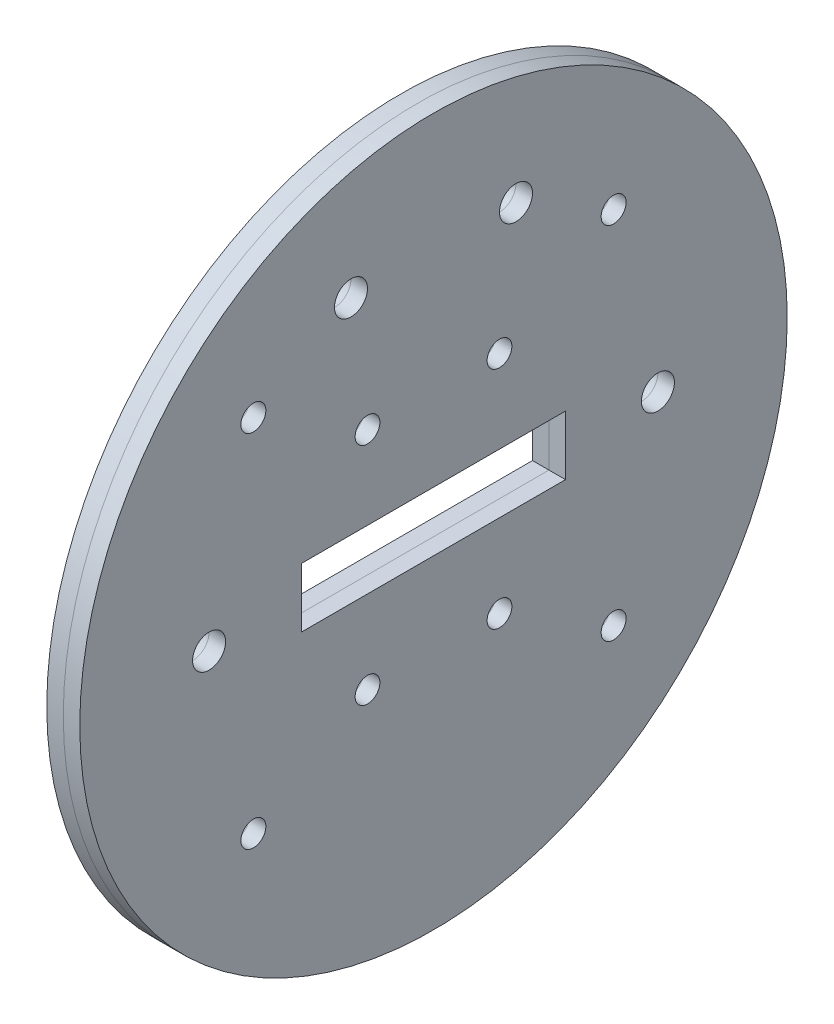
from build123d import *

# Parameters (mm, degrees)
SKETCH1_R               = 68.072
BOSS_EXTRUDE1_DEPTH     = 3.175
SKETCH4_R               = 68.072
BOSS_EXTRUDE2_DEPTH     = 3.175
CUT_EXTRUDE1_DEPTH      = 97.320688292
CUT_EXTRUDE1_DEPTH_BACK = 97.320688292
SKETCH2_R               = 3.175
CUT_EXTRUDE2_DEPTH      = 97.320688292
CUT_EXTRUDE2_DEPTH_BACK = 97.320688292
SKETCH3_W               = 50.8
SKETCH3_H               = 11.43
SKETCH5_R               = 3.175
CUT_EXTRUDE3_DEPTH      = 97.477545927
SKETCH6_R               = 2.38125
CUT_EXTRUDE4_DEPTH      = 97.477545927
SKETCH7_R               = 2.4003
CUT_EXTRUDE5_DEPTH      = 97.477545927


with BuildPart() as part:
    # Sketch1 → Boss-Extrude1 (new body)
    with BuildSketch(Plane(origin=(0, 0, 0), x_dir=(0, 0, -1), z_dir=(1, 0, 0))):
        Circle(SKETCH1_R)
    extrude(amount=BOSS_EXTRUDE1_DEPTH)


with BuildPart() as body_2:
    # Sketch4 → Boss-Extrude2 (new body)
    with BuildSketch(Plane(origin=(3.175, 0, 0), x_dir=(0, 0, -1), z_dir=(1, 0, 0))):
        Circle(SKETCH4_R)
    extrude(amount=BOSS_EXTRUDE2_DEPTH)


with BuildPart() as cut_extrude1_tool:
    # Sketch2 → Cut-Extrude1 (new, two sides: drawn at the far end of the back side and taken through both)
    with BuildSketch(Plane(origin=(3.175, 0, 0), x_dir=(0, 0, -1), z_dir=(1, 0, 0)).offset(-CUT_EXTRUDE1_DEPTH_BACK)):
        with Locations((43.18, 0)):
            Circle(SKETCH2_R)
        with Locations((-43.18, 0)):
            Circle(SKETCH2_R)
    extrude(amount=CUT_EXTRUDE1_DEPTH + CUT_EXTRUDE1_DEPTH_BACK)


with BuildPart() as part_1:
    add(part.part)

    # Cut-Extrude1: cut by cut_extrude1_tool
    add(cut_extrude1_tool.part, mode=Mode.SUBTRACT)


with BuildPart() as body_2_1:
    add(body_2.part)

    # Cut-Extrude1: cut by cut_extrude1_tool
    add(cut_extrude1_tool.part, mode=Mode.SUBTRACT)


with BuildPart() as cut_extrude2_tool:
    # Sketch3 → Cut-Extrude2 (new, two sides: drawn at the far end of the back side and taken through both)
    with BuildSketch(Plane(origin=(3.175, 0, 0), x_dir=(0, 0, -1), z_dir=(1, 0, 0)).offset(-CUT_EXTRUDE2_DEPTH_BACK)):
        Rectangle(SKETCH3_W, SKETCH3_H)
    extrude(amount=CUT_EXTRUDE2_DEPTH + CUT_EXTRUDE2_DEPTH_BACK)


with BuildPart() as part_2:
    add(part_1.part)

    # Cut-Extrude2: cut by cut_extrude2_tool
    add(cut_extrude2_tool.part, mode=Mode.SUBTRACT)


with BuildPart() as body_2_2:
    add(body_2_1.part)

    # Cut-Extrude2: cut by cut_extrude2_tool
    add(cut_extrude2_tool.part, mode=Mode.SUBTRACT)


with BuildPart() as cut_extrude3_tool:
    # Sketch5 → Cut-Extrude3 (new, through all)
    with BuildSketch(Plane(origin=(6.35, 0, 0), x_dir=(0, 0, -1), z_dir=(1, 0, 0))):
        with Locations((-15.875, 45.212)):
            Circle(SKETCH5_R)
        with Locations((15.875, 45.212)):
            Circle(SKETCH5_R)
    extrude(amount=-CUT_EXTRUDE3_DEPTH)


with BuildPart() as part_3:
    add(part_2.part)

    # Cut-Extrude3: cut by cut_extrude3_tool
    add(cut_extrude3_tool.part, mode=Mode.SUBTRACT)


with BuildPart() as body_2_3:
    add(body_2_2.part)

    # Cut-Extrude3: cut by cut_extrude3_tool
    add(cut_extrude3_tool.part, mode=Mode.SUBTRACT)


with BuildPart() as cut_extrude4_tool:
    # Sketch6 → Cut-Extrude4 (new, through all)
    with BuildSketch(Plane(origin=(6.35, 0, 0), x_dir=(0, 0, -1), z_dir=(1, 0, 0))):
        with Locations((-12.7, 21.66874)):
            Circle(SKETCH6_R)
        with Locations((12.7, 21.66874)):
            Circle(SKETCH6_R)
        with Locations((12.7, -21.66874)):
            Circle(SKETCH6_R)
        with Locations((-12.7, -21.66874)):
            Circle(SKETCH6_R)
    extrude(amount=-CUT_EXTRUDE4_DEPTH)


with BuildPart() as part_4:
    add(part_3.part)

    # Cut-Extrude4: cut by cut_extrude4_tool
    add(cut_extrude4_tool.part, mode=Mode.SUBTRACT)


with BuildPart() as body_2_4:
    add(body_2_3.part)

    # Cut-Extrude4: cut by cut_extrude4_tool
    add(cut_extrude4_tool.part, mode=Mode.SUBTRACT)


with BuildPart() as cut_extrude5_tool:
    # Sketch7 → Cut-Extrude5 (new, through all)
    with BuildSketch(Plane(origin=(6.35, 0, 0), x_dir=(0, 0, -1), z_dir=(1, 0, 0))):
        with Locations((-34.663788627, -34.663788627)):
            Circle(SKETCH7_R)
        with Locations((-34.663788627, 34.663788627)):
            Circle(SKETCH7_R)
        with Locations((34.663788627, 34.663788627)):
            Circle(SKETCH7_R)
        with Locations((34.663788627, -34.663788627)):
            Circle(SKETCH7_R)
    extrude(amount=-CUT_EXTRUDE5_DEPTH)


with BuildPart() as part_5:
    add(part_4.part)

    # Cut-Extrude5: cut by cut_extrude5_tool
    add(cut_extrude5_tool.part, mode=Mode.SUBTRACT)


with BuildPart() as body_2_5:
    add(body_2_4.part)

    # Cut-Extrude5: cut by cut_extrude5_tool
    add(cut_extrude5_tool.part, mode=Mode.SUBTRACT)


solid = Compound([part_5.part, body_2_5.part])
